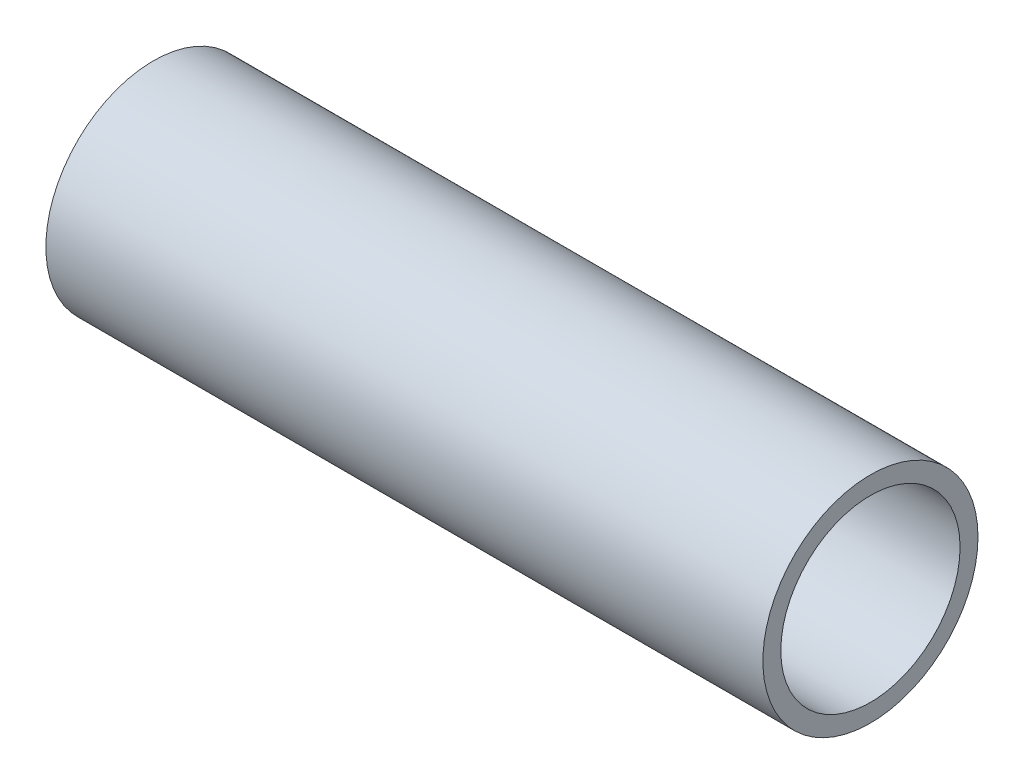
ISO-10303-21;
HEADER;
FILE_DESCRIPTION(('STEP AP214'),'2;1');
FILE_NAME('part.step','',(''),(''),'','','');
FILE_SCHEMA(('AUTOMOTIVE_DESIGN { 1 0 10303 214 1 1 1 1 }'));
ENDSEC;
DATA;
#1=APPLICATION_CONTEXT('core data for automotive mechanical design processes');
#2=APPLICATION_PROTOCOL_DEFINITION('international standard','automotive_design',2000,#1);
#3=PRODUCT_CONTEXT('',#1,'mechanical');
#4=PRODUCT('Part','Part','',(#3));
#5=PRODUCT_RELATED_PRODUCT_CATEGORY('part','',(#4));
#6=PRODUCT_DEFINITION_FORMATION('','',#4);
#7=PRODUCT_DEFINITION_CONTEXT('part definition',#1,'design');
#8=PRODUCT_DEFINITION('design','',#6,#7);
#9=PRODUCT_DEFINITION_SHAPE('','',#8);
#10=(LENGTH_UNIT() NAMED_UNIT(*) SI_UNIT(.MILLI.,.METRE.));
#11=(NAMED_UNIT(*) PLANE_ANGLE_UNIT() SI_UNIT($,.RADIAN.));
#12=(NAMED_UNIT(*) SI_UNIT($,.STERADIAN.) SOLID_ANGLE_UNIT());
#13=UNCERTAINTY_MEASURE_WITH_UNIT(LENGTH_MEASURE(1.E-05),#10,'distance_accuracy_value','');
#14=(GEOMETRIC_REPRESENTATION_CONTEXT(3) GLOBAL_UNCERTAINTY_ASSIGNED_CONTEXT((#13)) GLOBAL_UNIT_ASSIGNED_CONTEXT((#10,
#11,#12)) REPRESENTATION_CONTEXT('',''));
#15=CARTESIAN_POINT('',(0.,0.,0.));
#16=DIRECTION('',(0.,0.,1.));
#17=DIRECTION('',(1.,0.,0.));
#18=AXIS2_PLACEMENT_3D('',#15,#16,#17);
#19=CARTESIAN_POINT('',(400.,0.,0.));
#20=DIRECTION('',(1.,0.,0.));
#21=DIRECTION('',(0.,0.,-1.));
#22=AXIS2_PLACEMENT_3D('',#19,#20,#21);
#23=PLANE('',#22);
#24=CARTESIAN_POINT('',(400.,0.,0.));
#25=DIRECTION('',(1.,0.,0.));
#26=DIRECTION('',(0.,0.,-1.));
#27=AXIS2_PLACEMENT_3D('',#24,#25,#26);
#28=CIRCLE('',#27,60.);
#29=CARTESIAN_POINT('',(400.,0.,-60.));
#30=VERTEX_POINT('',#29);
#31=EDGE_CURVE('E11',#30,#30,#28,.T.);
#32=ORIENTED_EDGE('',*,*,#31,.T.);
#33=EDGE_LOOP('',(#32));
#34=FACE_BOUND('',#33,.T.);
#35=CARTESIAN_POINT('',(400.,0.,0.));
#36=DIRECTION('',(1.,0.,0.));
#37=DIRECTION('',(0.,0.,-1.));
#38=AXIS2_PLACEMENT_3D('',#35,#36,#37);
#39=CIRCLE('',#38,50.);
#40=CARTESIAN_POINT('',(400.,0.,-50.));
#41=VERTEX_POINT('',#40);
#42=EDGE_CURVE('E56',#41,#41,#39,.T.);
#43=ORIENTED_EDGE('',*,*,#42,.F.);
#44=EDGE_LOOP('',(#43));
#45=FACE_BOUND('',#44,.T.);
#46=ADVANCED_FACE('F37',(#34,#45),#23,.T.);
#47=CARTESIAN_POINT('',(0.,0.,0.));
#48=DIRECTION('',(1.,0.,0.));
#49=DIRECTION('',(0.,0.,-1.));
#50=AXIS2_PLACEMENT_3D('',#47,#48,#49);
#51=PLANE('',#50);
#52=CARTESIAN_POINT('',(0.,0.,0.));
#53=DIRECTION('',(1.,0.,0.));
#54=DIRECTION('',(0.,0.,-1.));
#55=AXIS2_PLACEMENT_3D('',#52,#53,#54);
#56=CIRCLE('',#55,60.);
#57=CARTESIAN_POINT('',(0.,0.,-60.));
#58=VERTEX_POINT('',#57);
#59=EDGE_CURVE('E51',#58,#58,#56,.T.);
#60=ORIENTED_EDGE('',*,*,#59,.F.);
#61=EDGE_LOOP('',(#60));
#62=FACE_BOUND('',#61,.T.);
#63=CARTESIAN_POINT('',(0.,0.,0.));
#64=DIRECTION('',(1.,0.,0.));
#65=DIRECTION('',(0.,0.,-1.));
#66=AXIS2_PLACEMENT_3D('',#63,#64,#65);
#67=CIRCLE('',#66,50.);
#68=CARTESIAN_POINT('',(0.,0.,-50.));
#69=VERTEX_POINT('',#68);
#70=EDGE_CURVE('E58',#69,#69,#67,.T.);
#71=ORIENTED_EDGE('',*,*,#70,.T.);
#72=EDGE_LOOP('',(#71));
#73=FACE_BOUND('',#72,.T.);
#74=ADVANCED_FACE('F81',(#62,#73),#51,.F.);
#75=CARTESIAN_POINT('',(400.,0.,0.));
#76=DIRECTION('',(-1.,0.,0.));
#77=DIRECTION('',(0.,0.,1.));
#78=AXIS2_PLACEMENT_3D('',#75,#76,#77);
#79=CYLINDRICAL_SURFACE('',#78,60.);
#80=CARTESIAN_POINT('',(240.,0.,-60.));
#81=CARTESIAN_POINT('',(239.999999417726,1.00486330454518,-59.9999994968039));
#82=CARTESIAN_POINT('',(239.962083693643,2.00973297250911,-59.9747024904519));
#83=CARTESIAN_POINT('',(239.811017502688,4.01125743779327,-59.8741509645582));
#84=CARTESIAN_POINT('',(239.697866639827,5.00791219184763,-59.7988961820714));
#85=CARTESIAN_POINT('',(239.398000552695,6.98557742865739,-59.6002504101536));
#86=CARTESIAN_POINT('',(239.211256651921,7.96658165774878,-59.4768406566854));
#87=CARTESIAN_POINT('',(238.766879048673,9.90547341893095,-59.1848197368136));
#88=CARTESIAN_POINT('',(238.509244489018,10.8633606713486,-59.0162080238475));
#89=CARTESIAN_POINT('',(237.927840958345,12.7453663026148,-58.6384902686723));
#90=CARTESIAN_POINT('',(237.604393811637,13.6696241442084,-58.4295815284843));
#91=CARTESIAN_POINT('',(236.894317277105,15.4841414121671,-57.9751346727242));
#92=CARTESIAN_POINT('',(236.507688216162,16.3744010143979,-57.7295967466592));
#93=CARTESIAN_POINT('',(235.675061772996,18.1169109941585,-57.2066873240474));
#94=CARTESIAN_POINT('',(235.229064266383,18.9691612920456,-56.9293157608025));
#95=CARTESIAN_POINT('',(234.281404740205,20.6325394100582,-56.347801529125));
#96=CARTESIAN_POINT('',(233.779740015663,21.4436652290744,-56.0436575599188));
#97=CARTESIAN_POINT('',(232.679409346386,23.0893332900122,-55.3871156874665));
#98=CARTESIAN_POINT('',(232.076125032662,23.9200269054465,-55.0328130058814));
#99=CARTESIAN_POINT('',(230.81200785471,25.5277510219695,-54.3057312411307));
#100=CARTESIAN_POINT('',(230.15117237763,26.3047790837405,-53.9329513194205));
#101=CARTESIAN_POINT('',(228.774339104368,27.8042229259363,-53.1754792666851));
#102=CARTESIAN_POINT('',(228.058268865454,28.5265644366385,-52.7907719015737));
#103=CARTESIAN_POINT('',(226.574443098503,29.9137194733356,-52.0173061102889));
#104=CARTESIAN_POINT('',(225.806684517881,30.5785295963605,-51.6285474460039));
#105=CARTESIAN_POINT('',(224.09645518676,31.9490834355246,-50.7936732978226));
#106=CARTESIAN_POINT('',(223.145538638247,32.6447172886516,-50.3481930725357));
#107=CARTESIAN_POINT('',(221.179931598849,33.952975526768,-49.4753878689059));
#108=CARTESIAN_POINT('',(220.165226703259,34.5655810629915,-49.0480670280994));
#109=CARTESIAN_POINT('',(218.076384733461,35.7023288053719,-48.2269083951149));
#110=CARTESIAN_POINT('',(217.002330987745,36.2265910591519,-47.8330255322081));
#111=CARTESIAN_POINT('',(214.797419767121,37.181690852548,-47.0944422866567));
#112=CARTESIAN_POINT('',(213.666589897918,37.6125732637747,-46.7497183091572));
#113=CARTESIAN_POINT('',(211.688098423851,38.2640577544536,-46.2167109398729));
#114=CARTESIAN_POINT('',(210.85296034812,38.5094524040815,-46.0119976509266));
#115=CARTESIAN_POINT('',(209.160161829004,38.9468252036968,-45.6423806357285));
#116=CARTESIAN_POINT('',(208.302505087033,39.1388120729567,-45.4774704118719));
#117=CARTESIAN_POINT('',(206.570323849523,39.4665246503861,-45.1933685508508));
#118=CARTESIAN_POINT('',(205.69582628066,39.6023334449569,-45.0741094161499));
#119=CARTESIAN_POINT('',(203.934354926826,39.8159239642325,-44.8855503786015));
#120=CARTESIAN_POINT('',(203.047381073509,39.8937053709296,-44.8162507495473));
#121=CARTESIAN_POINT('',(201.263947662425,39.9900380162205,-44.730315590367));
#122=CARTESIAN_POINT('',(200.367464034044,40.0083426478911,-44.713899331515));
#123=CARTESIAN_POINT('',(198.575938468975,39.9846795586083,-44.7350604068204));
#124=CARTESIAN_POINT('',(197.680896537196,39.9427116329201,-44.7726379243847));
#125=CARTESIAN_POINT('',(195.898750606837,39.799241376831,-44.9002171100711));
#126=CARTESIAN_POINT('',(195.011653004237,39.6976948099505,-44.9902577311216));
#127=CARTESIAN_POINT('',(193.252447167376,39.436802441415,-45.2191173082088));
#128=CARTESIAN_POINT('',(192.380339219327,39.2774555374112,-45.3579371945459));
#129=CARTESIAN_POINT('',(190.694798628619,38.9117417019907,-45.6720005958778));
#130=CARTESIAN_POINT('',(189.880482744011,38.7077853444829,-45.8453462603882));
#131=CARTESIAN_POINT('',(188.273489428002,38.251626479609,-46.2266306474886));
#132=CARTESIAN_POINT('',(187.480820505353,37.999405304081,-46.434582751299));
#133=CARTESIAN_POINT('',(185.919911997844,37.4491133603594,-46.8795160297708));
#134=CARTESIAN_POINT('',(185.151674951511,37.1510378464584,-47.1165002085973));
#135=CARTESIAN_POINT('',(183.641695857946,36.5113426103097,-47.6139262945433));
#136=CARTESIAN_POINT('',(182.899947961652,36.1697325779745,-47.8743629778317));
#137=CARTESIAN_POINT('',(181.295731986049,35.3710116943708,-48.4684121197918));
#138=CARTESIAN_POINT('',(180.439432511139,34.9045455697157,-48.8061273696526));
#139=CARTESIAN_POINT('',(178.768422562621,33.9140631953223,-49.4995138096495));
#140=CARTESIAN_POINT('',(177.95371607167,33.390041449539,-49.8551867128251));
#141=CARTESIAN_POINT('',(176.366512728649,32.2861224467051,-50.5770864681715));
#142=CARTESIAN_POINT('',(175.594063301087,31.7061643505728,-50.9433245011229));
#143=CARTESIAN_POINT('',(174.09391618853,30.4927149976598,-51.6787949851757));
#144=CARTESIAN_POINT('',(173.366221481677,29.8592201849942,-52.0480276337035));
#145=CARTESIAN_POINT('',(171.805395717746,28.3978976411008,-52.8620988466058));
#146=CARTESIAN_POINT('',(170.983393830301,27.5576321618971,-53.3060606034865));
#147=CARTESIAN_POINT('',(169.412496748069,25.802935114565,-54.1771932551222));
#148=CARTESIAN_POINT('',(168.663615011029,24.8884899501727,-54.6043610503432));
#149=CARTESIAN_POINT('',(167.244963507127,22.9893722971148,-55.4306802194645));
#150=CARTESIAN_POINT('',(166.575135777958,22.0047521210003,-55.8298520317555));
#151=CARTESIAN_POINT('',(165.320469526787,19.9689470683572,-56.5899352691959));
#152=CARTESIAN_POINT('',(164.735607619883,18.9177806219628,-56.9508572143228));
#153=CARTESIAN_POINT('',(163.763618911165,16.9666922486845,-57.5583288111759));
#154=CARTESIAN_POINT('',(163.360204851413,16.0775143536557,-57.8134295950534));
#155=CARTESIAN_POINT('',(162.616753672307,14.2637006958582,-58.287434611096));
#156=CARTESIAN_POINT('',(162.27670914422,13.3390690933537,-58.5063430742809));
#157=CARTESIAN_POINT('',(161.664012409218,11.4598454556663,-58.90325550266));
#158=CARTESIAN_POINT('',(161.391314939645,10.5052740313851,-59.0812869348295));
#159=CARTESIAN_POINT('',(160.916495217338,8.57150864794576,-59.3926610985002));
#160=CARTESIAN_POINT('',(160.714374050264,7.59231431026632,-59.5260031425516));
#161=CARTESIAN_POINT('',(160.382853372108,5.61194628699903,-59.7453157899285));
#162=CARTESIAN_POINT('',(160.253775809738,4.61069519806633,-59.8310766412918));
#163=CARTESIAN_POINT('',(160.071690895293,2.59823982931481,-59.9521912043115));
#164=CARTESIAN_POINT('',(160.018683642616,1.58703553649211,-59.9875448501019));
#165=CARTESIAN_POINT('',(159.989583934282,-0.436929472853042,-60.0069435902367));
#166=CARTESIAN_POINT('',(160.013488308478,-1.44969012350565,-59.990990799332));
#167=CARTESIAN_POINT('',(160.137825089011,-3.46836313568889,-59.908186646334));
#168=CARTESIAN_POINT('',(160.238254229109,-4.47427578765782,-59.8413374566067));
#169=CARTESIAN_POINT('',(160.504337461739,-6.40084352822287,-59.6648829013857));
#170=CARTESIAN_POINT('',(160.66490330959,-7.32251623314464,-59.5586180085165));
#171=CARTESIAN_POINT('',(161.0487317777,-9.14700315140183,-59.3058212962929));
#172=CARTESIAN_POINT('',(161.271990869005,-10.0498184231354,-59.1592917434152));
#173=CARTESIAN_POINT('',(161.778604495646,-11.8314321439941,-58.8288893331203));
#174=CARTESIAN_POINT('',(162.061962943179,-12.7102290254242,-58.6450140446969));
#175=CARTESIAN_POINT('',(162.685784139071,-14.4393277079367,-58.243400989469));
#176=CARTESIAN_POINT('',(163.026249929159,-15.2896279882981,-58.0256614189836));
#177=CARTESIAN_POINT('',(163.783369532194,-17.0085335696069,-57.5460976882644));
#178=CARTESIAN_POINT('',(164.20338654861,-17.8751339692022,-57.2824033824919));
#179=CARTESIAN_POINT('',(165.100340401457,-19.5686502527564,-56.7262060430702));
#180=CARTESIAN_POINT('',(165.577278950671,-20.395564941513,-56.4337021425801));
#181=CARTESIAN_POINT('',(166.584765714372,-22.0074044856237,-55.8248751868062));
#182=CARTESIAN_POINT('',(167.115339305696,-22.7923091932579,-55.5085408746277));
#183=CARTESIAN_POINT('',(168.226693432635,-24.3176395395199,-54.8574535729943));
#184=CARTESIAN_POINT('',(168.807476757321,-25.0580627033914,-54.5226995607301));
#185=CARTESIAN_POINT('',(170.112094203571,-26.6062694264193,-53.7861759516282));
#186=CARTESIAN_POINT('',(170.844025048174,-27.406184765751,-53.382181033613));
#187=CARTESIAN_POINT('',(172.367867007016,-28.9419367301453,-52.5653965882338));
#188=CARTESIAN_POINT('',(173.159786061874,-29.6777648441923,-52.1526059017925));
#189=CARTESIAN_POINT('',(174.801195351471,-31.0835760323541,-51.3271479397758));
#190=CARTESIAN_POINT('',(175.65072432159,-31.7535140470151,-50.9144809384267));
#191=CARTESIAN_POINT('',(177.404470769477,-33.0244551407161,-50.0994522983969));
#192=CARTESIAN_POINT('',(178.308682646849,-33.6254652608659,-49.697089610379));
#193=CARTESIAN_POINT('',(180.091034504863,-34.7077254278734,-48.9466046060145));
#194=CARTESIAN_POINT('',(180.964914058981,-35.1948048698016,-48.5967727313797));
#195=CARTESIAN_POINT('',(182.755109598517,-36.1057092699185,-47.9238814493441));
#196=CARTESIAN_POINT('',(183.671426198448,-36.5295333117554,-47.6008224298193));
#197=CARTESIAN_POINT('',(185.542677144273,-37.3096742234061,-46.9918381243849));
#198=CARTESIAN_POINT('',(186.497552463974,-37.6660898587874,-46.7058587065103));
#199=CARTESIAN_POINT('',(188.443450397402,-38.3078968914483,-46.1809182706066));
#200=CARTESIAN_POINT('',(189.434464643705,-38.5933046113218,-45.9419464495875));
#201=CARTESIAN_POINT('',(191.266034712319,-39.0440828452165,-45.5590890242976));
#202=CARTESIAN_POINT('',(192.101599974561,-39.2218098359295,-45.4058321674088));
#203=CARTESIAN_POINT('',(193.789062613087,-39.5241525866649,-45.1429027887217));
#204=CARTESIAN_POINT('',(194.640958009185,-39.6487747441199,-45.0332250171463));
#205=CARTESIAN_POINT('',(196.35501761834,-39.8429074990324,-44.8615604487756));
#206=CARTESIAN_POINT('',(197.217171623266,-39.9124688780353,-44.7995297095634));
#207=CARTESIAN_POINT('',(198.946362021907,-39.9954877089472,-44.7254303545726));
#208=CARTESIAN_POINT('',(199.813398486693,-40.0089443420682,-44.7133624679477));
#209=CARTESIAN_POINT('',(201.546230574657,-39.979501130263,-44.7396899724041));
#210=CARTESIAN_POINT('',(202.412025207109,-39.9365691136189,-44.7781141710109));
#211=CARTESIAN_POINT('',(204.135405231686,-39.7950504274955,-44.90392887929));
#212=CARTESIAN_POINT('',(204.992990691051,-39.696464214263,-44.9913189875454));
#213=CARTESIAN_POINT('',(206.695163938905,-39.4450990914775,-45.2118569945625));
#214=CARTESIAN_POINT('',(207.539735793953,-39.2922585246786,-45.3450569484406));
#215=CARTESIAN_POINT('',(209.210162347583,-38.9345969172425,-45.6525204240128));
#216=CARTESIAN_POINT('',(210.0360146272,-38.7297692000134,-45.8267892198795));
#217=CARTESIAN_POINT('',(211.882463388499,-38.2093696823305,-46.2621637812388));
#218=CARTESIAN_POINT('',(212.896321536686,-37.878832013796,-46.5340350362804));
#219=CARTESIAN_POINT('',(214.882953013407,-37.1432441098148,-47.1232556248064));
#220=CARTESIAN_POINT('',(215.855714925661,-36.7381733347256,-47.4406174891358));
#221=CARTESIAN_POINT('',(217.757719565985,-35.8575360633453,-48.1096989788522));
#222=CARTESIAN_POINT('',(218.686914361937,-35.3818942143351,-48.4614551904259));
#223=CARTESIAN_POINT('',(220.498369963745,-34.364170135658,-49.1883605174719));
#224=CARTESIAN_POINT('',(221.380633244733,-33.8220914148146,-49.5635083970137));
#225=CARTESIAN_POINT('',(223.112090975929,-32.6639811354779,-50.334451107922));
#226=CARTESIAN_POINT('',(223.960393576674,-32.0467850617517,-50.730497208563));
#227=CARTESIAN_POINT('',(225.604581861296,-30.749020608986,-51.5274452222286));
#228=CARTESIAN_POINT('',(226.400467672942,-30.0684523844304,-51.928347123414));
#229=CARTESIAN_POINT('',(227.937705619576,-28.6457956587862,-52.7265002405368));
#230=CARTESIAN_POINT('',(228.679042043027,-27.9036895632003,-53.1237503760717));
#231=CARTESIAN_POINT('',(230.104020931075,-26.3600322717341,-53.9063785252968));
#232=CARTESIAN_POINT('',(230.787658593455,-25.5584761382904,-54.291755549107));
#233=CARTESIAN_POINT('',(232.187538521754,-23.7786056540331,-55.096861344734));
#234=CARTESIAN_POINT('',(232.894329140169,-22.7914495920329,-55.5135592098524));
#235=CARTESIAN_POINT('',(234.221279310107,-20.7458344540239,-56.3099843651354));
#236=CARTESIAN_POINT('',(234.841426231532,-19.68736501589,-56.6897062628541));
#237=CARTESIAN_POINT('',(235.700377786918,-18.0516522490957,-57.2229579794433));
#238=CARTESIAN_POINT('',(235.974714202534,-17.4986612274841,-57.3945873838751));
#239=CARTESIAN_POINT('',(236.498847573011,-16.3773309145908,-57.7245559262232));
#240=CARTESIAN_POINT('',(236.74864795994,-15.8089937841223,-57.8828969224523));
#241=CARTESIAN_POINT('',(237.222673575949,-14.6580964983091,-58.1849987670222));
#242=CARTESIAN_POINT('',(237.446904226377,-14.0755393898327,-58.328762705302));
#243=CARTESIAN_POINT('',(237.868844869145,-12.8973718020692,-58.6005409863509));
#244=CARTESIAN_POINT('',(238.066556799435,-12.3017622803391,-58.7285564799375));
#245=CARTESIAN_POINT('',(238.536734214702,-10.7646074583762,-59.0341625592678));
#246=CARTESIAN_POINT('',(238.789751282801,-9.81460976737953,-59.1998120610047));
#247=CARTESIAN_POINT('',(239.226043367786,-7.89233195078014,-59.486599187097));
#248=CARTESIAN_POINT('',(239.409329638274,-6.92005544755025,-59.6077439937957));
#249=CARTESIAN_POINT('',(239.703582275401,-4.96048196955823,-59.8026945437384));
#250=CARTESIAN_POINT('',(239.814593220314,-3.9731946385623,-59.8765294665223));
#251=CARTESIAN_POINT('',(239.962803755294,-1.99060715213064,-59.9751833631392));
#252=CARTESIAN_POINT('',(240.000000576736,-0.995306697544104,-60.0000004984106));
#253=CARTESIAN_POINT('',(240.,0.,-60.));
#254=B_SPLINE_CURVE_WITH_KNOTS('',3,(#80,#81,#82,#83,#84,#85,#86,#87,#88,#89,#90,#91,#92,#93,
#94,#95,#96,#97,#98,#99,#100,#101,#102,#103,#104,#105,#106,#107,#108,#109,#110,#111,#112,#113,
#114,#115,#116,#117,#118,#119,#120,#121,#122,#123,#124,#125,#126,#127,#128,#129,#130,#131,#132,
#133,#134,#135,#136,#137,#138,#139,#140,#141,#142,#143,#144,#145,#146,#147,#148,#149,#150,#151,
#152,#153,#154,#155,#156,#157,#158,#159,#160,#161,#162,#163,#164,#165,#166,#167,#168,#169,#170,
#171,#172,#173,#174,#175,#176,#177,#178,#179,#180,#181,#182,#183,#184,#185,#186,#187,#188,#189,
#190,#191,#192,#193,#194,#195,#196,#197,#198,#199,#200,#201,#202,#203,#204,#205,#206,#207,#208,
#209,#210,#211,#212,#213,#214,#215,#216,#217,#218,#219,#220,#221,#222,#223,#224,#225,#226,#227,
#228,#229,#230,#231,#232,#233,#234,#235,#236,#237,#238,#239,#240,#241,#242,#243,#244,#245,#246,
#247,#248,#249,#250,#251,#252,#253),.UNSPECIFIED.,.T.,.F.,(4,2,2,2,2,2,2,2,2,2,2,2,2,2,2,2,2,2,
2,2,2,2,2,2,2,2,2,2,2,2,2,2,2,2,2,2,2,2,2,2,2,2,2,2,2,2,2,2,2,2,2,2,2,2,2,2,2,2,2,2,2,2,2,2,2,2,
2,2,2,2,2,2,2,2,2,2,2,2,2,2,2,2,2,2,2,2,4),(0.,3.01357720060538,6.02717026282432,
9.04193877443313,12.0567437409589,15.0571460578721,18.0575328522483,21.0579259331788,
24.0584648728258,27.3134889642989,30.5686609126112,33.828177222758,37.0878862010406,
40.8622638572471,44.6374969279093,48.4075578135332,52.1758030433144,54.85593019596,
57.5356195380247,60.2113313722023,62.8870578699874,65.573864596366,68.2606804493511,
70.9494937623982,73.6383583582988,76.2074526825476,78.777542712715,81.3478989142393,
83.9176840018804,87.0106714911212,90.1039545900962,93.2006408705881,96.2975329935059,
100.062643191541,103.82844505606,107.5914684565,111.353454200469,114.377999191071,
117.402190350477,120.424343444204,123.446543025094,126.48196159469,129.517384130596,
132.55268155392,135.587849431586,138.409392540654,141.230776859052,144.052344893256,
146.874063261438,149.866497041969,152.859020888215,155.852967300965,158.84708012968,
162.314751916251,165.782883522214,169.253370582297,172.723502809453,175.900211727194,
179.076966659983,182.249030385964,185.420364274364,188.021408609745,190.622139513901,
193.220469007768,195.8188364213,198.418686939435,201.018516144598,203.621309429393,
206.224437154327,209.521126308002,212.818725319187,216.119871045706,219.42084249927,
222.781777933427,226.142705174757,229.504596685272,232.866767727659,236.712493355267,
240.558778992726,242.480270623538,244.4014930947,246.322307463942,248.242981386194,
251.230112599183,254.216761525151,257.201566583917,260.18648359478),.UNSPECIFIED.);
#255=CARTESIAN_POINT('',(240.,0.,-60.));
#256=VERTEX_POINT('',#255);
#257=EDGE_CURVE('E61',#256,#256,#254,.T.);
#258=ORIENTED_EDGE('',*,*,#257,.T.);
#259=EDGE_LOOP('',(#258));
#260=FACE_BOUND('',#259,.T.);
#261=ORIENTED_EDGE('',*,*,#31,.F.);
#262=EDGE_LOOP('',(#261));
#263=FACE_BOUND('',#262,.T.);
#264=ORIENTED_EDGE('',*,*,#59,.T.);
#265=EDGE_LOOP('',(#264));
#266=FACE_BOUND('',#265,.T.);
#267=ADVANCED_FACE('F39',(#260,#263,#266),#79,.T.);
#268=CARTESIAN_POINT('',(400.,0.,0.));
#269=DIRECTION('',(-1.,0.,0.));
#270=DIRECTION('',(0.,0.,1.));
#271=AXIS2_PLACEMENT_3D('',#268,#269,#270);
#272=CYLINDRICAL_SURFACE('',#271,50.);
#273=CARTESIAN_POINT('',(240.,0.,-50.));
#274=CARTESIAN_POINT('',(239.999989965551,0.960337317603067,-49.9999902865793));
#275=CARTESIAN_POINT('',(239.965344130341,1.92103825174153,-49.9722619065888));
#276=CARTESIAN_POINT('',(239.827340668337,3.8346071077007,-49.8619634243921));
#277=CARTESIAN_POINT('',(239.723946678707,4.78747061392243,-49.7793642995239));
#278=CARTESIAN_POINT('',(239.450009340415,6.67920680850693,-49.5610369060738));
#279=CARTESIAN_POINT('',(239.27933763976,7.61804917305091,-49.425207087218));
#280=CARTESIAN_POINT('',(238.87373837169,9.47278784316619,-49.103485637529));
#281=CARTESIAN_POINT('',(238.638817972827,10.3886866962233,-48.9175995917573));
#282=CARTESIAN_POINT('',(238.110003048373,12.1860448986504,-48.5009896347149));
#283=CARTESIAN_POINT('',(237.816496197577,13.0676873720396,-48.2705607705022));
#284=CARTESIAN_POINT('',(237.173486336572,14.7981074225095,-47.7684806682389));
#285=CARTESIAN_POINT('',(236.823982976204,15.6468847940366,-47.4968291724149));
#286=CARTESIAN_POINT('',(236.073099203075,17.3078631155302,-46.917071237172));
#287=CARTESIAN_POINT('',(235.67173175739,18.1200731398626,-46.6089739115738));
#288=CARTESIAN_POINT('',(234.820820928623,19.7058441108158,-45.9609995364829));
#289=CARTESIAN_POINT('',(234.371267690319,20.4793971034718,-45.6211159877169));
#290=CARTESIAN_POINT('',(233.581386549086,21.7405090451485,-45.0296027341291));
#291=CARTESIAN_POINT('',(233.253165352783,22.2391661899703,-44.785278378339));
#292=CARTESIAN_POINT('',(232.577557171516,23.2175821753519,-44.2859517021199));
#293=CARTESIAN_POINT('',(232.230174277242,23.6973450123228,-44.0309516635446));
#294=CARTESIAN_POINT('',(231.160274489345,25.1083888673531,-43.2518566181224));
#295=CARTESIAN_POINT('',(230.410118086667,26.0112478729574,-42.7137507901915));
#296=CARTESIAN_POINT('',(228.840444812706,27.7416200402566,-41.6107960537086));
#297=CARTESIAN_POINT('',(228.020749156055,28.5689268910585,-41.0458799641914));
#298=CARTESIAN_POINT('',(226.317857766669,30.1449198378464,-39.9027716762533));
#299=CARTESIAN_POINT('',(225.434669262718,30.8936148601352,-39.3245809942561));
#300=CARTESIAN_POINT('',(223.592558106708,32.322928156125,-38.158764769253));
#301=CARTESIAN_POINT('',(222.632666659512,33.0022979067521,-37.5711331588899));
#302=CARTESIAN_POINT('',(221.145835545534,33.9588113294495,-36.7013004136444));
#303=CARTESIAN_POINT('',(220.64224039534,34.2673057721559,-36.4132103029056));
#304=CARTESIAN_POINT('',(219.619273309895,34.8630820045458,-35.843204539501));
#305=CARTESIAN_POINT('',(219.099902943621,35.1503658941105,-35.5612882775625));
#306=CARTESIAN_POINT('',(218.046651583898,35.7025344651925,-35.0068809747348));
#307=CARTESIAN_POINT('',(217.512813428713,35.9674773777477,-34.7343665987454));
#308=CARTESIAN_POINT('',(216.429076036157,36.4752457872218,-34.20076131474));
#309=CARTESIAN_POINT('',(215.879175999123,36.7180701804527,-33.9396709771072));
#310=CARTESIAN_POINT('',(214.763619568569,37.1806380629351,-33.4322884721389));
#311=CARTESIAN_POINT('',(214.197975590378,37.4003991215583,-33.1859851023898));
#312=CARTESIAN_POINT('',(213.050556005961,37.8160719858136,-32.7115298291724));
#313=CARTESIAN_POINT('',(212.468781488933,38.0119853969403,-32.4833767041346));
#314=CARTESIAN_POINT('',(211.200815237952,38.4063287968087,-32.0165695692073));
#315=CARTESIAN_POINT('',(210.51204347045,38.6007341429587,-31.7814677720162));
#316=CARTESIAN_POINT('',(209.11450642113,38.9543981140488,-31.3469842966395));
#317=CARTESIAN_POINT('',(208.405744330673,39.1136623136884,-31.1475969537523));
#318=CARTESIAN_POINT('',(206.971740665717,39.3945089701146,-30.7916235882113));
#319=CARTESIAN_POINT('',(206.246537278,39.5161707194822,-30.6349475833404));
#320=CARTESIAN_POINT('',(204.781735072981,39.7200407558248,-30.3701570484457));
#321=CARTESIAN_POINT('',(204.042136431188,39.802249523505,-30.2620419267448));
#322=CARTESIAN_POINT('',(202.546896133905,39.9259430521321,-30.09866807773));
#323=CARTESIAN_POINT('',(201.791170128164,39.9670566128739,-30.0438912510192));
#324=CARTESIAN_POINT('',(200.276633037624,40.0062151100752,-29.991729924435));
#325=CARTESIAN_POINT('',(199.517822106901,40.0042621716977,-29.9943425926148));
#326=CARTESIAN_POINT('',(198.003382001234,39.9573259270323,-30.0568391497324));
#327=CARTESIAN_POINT('',(197.247755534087,39.9123114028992,-30.1167645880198));
#328=CARTESIAN_POINT('',(195.746506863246,39.7803459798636,-30.2908537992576));
#329=CARTESIAN_POINT('',(195.000886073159,39.6933892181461,-30.4050251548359));
#330=CARTESIAN_POINT('',(193.409256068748,39.4627146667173,-30.7039918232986));
#331=CARTESIAN_POINT('',(192.565783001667,39.3122468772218,-30.8970395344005));
#332=CARTESIAN_POINT('',(190.904171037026,38.9613603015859,-31.3383396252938));
#333=CARTESIAN_POINT('',(190.086037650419,38.7609307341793,-31.5866039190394));
#334=CARTESIAN_POINT('',(188.475893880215,38.3131195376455,-32.1283140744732));
#335=CARTESIAN_POINT('',(187.683953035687,38.0656231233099,-32.4218700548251));
#336=CARTESIAN_POINT('',(186.129176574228,37.5270208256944,-33.0437864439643));
#337=CARTESIAN_POINT('',(185.366343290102,37.2359114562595,-33.3721496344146));
#338=CARTESIAN_POINT('',(184.060276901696,36.6918302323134,-33.9680518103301));
#339=CARTESIAN_POINT('',(183.510543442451,36.4479938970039,-34.2298156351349));
#340=CARTESIAN_POINT('',(182.427058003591,35.9381443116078,-34.7647275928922));
#341=CARTESIAN_POINT('',(181.893307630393,35.6721288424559,-35.0378768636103));
#342=CARTESIAN_POINT('',(180.841478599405,35.1184343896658,-35.592825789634));
#343=CARTESIAN_POINT('',(180.323406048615,34.8307471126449,-35.8746287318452));
#344=CARTESIAN_POINT('',(179.30305084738,34.2342731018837,-36.4442690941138));
#345=CARTESIAN_POINT('',(178.800767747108,33.9254869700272,-36.7321063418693));
#346=CARTESIAN_POINT('',(177.316270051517,32.9672187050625,-37.601947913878));
#347=CARTESIAN_POINT('',(176.357426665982,32.2863649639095,-38.1897349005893));
#348=CARTESIAN_POINT('',(174.503285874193,30.8431085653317,-39.3645658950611));
#349=CARTESIAN_POINT('',(173.607978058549,30.080719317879,-39.9516100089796));
#350=CARTESIAN_POINT('',(171.859919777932,28.453465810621,-41.1270547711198));
#351=CARTESIAN_POINT('',(171.008951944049,27.5864034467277,-41.7150704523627));
#352=CARTESIAN_POINT('',(169.380826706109,25.7673359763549,-42.8625772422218));
#353=CARTESIAN_POINT('',(168.603680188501,24.8153183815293,-43.4220641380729));
#354=CARTESIAN_POINT('',(167.49981524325,23.3263522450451,-44.2289438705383));
#355=CARTESIAN_POINT('',(167.142493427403,22.8204057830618,-44.492266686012));
#356=CARTESIAN_POINT('',(166.449102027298,21.7881562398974,-45.0067623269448));
#357=CARTESIAN_POINT('',(166.113031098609,21.2618544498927,-45.2579359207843));
#358=CARTESIAN_POINT('',(165.463467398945,20.1896164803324,-45.7463252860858));
#359=CARTESIAN_POINT('',(165.149963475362,19.6436902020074,-45.9835479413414));
#360=CARTESIAN_POINT('',(164.546539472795,18.5324581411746,-46.4425398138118));
#361=CARTESIAN_POINT('',(164.256625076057,17.9671477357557,-46.6643053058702));
#362=CARTESIAN_POINT('',(163.58402038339,16.5741428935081,-47.1811352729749));
#363=CARTESIAN_POINT('',(163.214162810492,15.736897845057,-47.4673728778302));
#364=CARTESIAN_POINT('',(162.52923808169,14.0281401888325,-48.0001216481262));
#365=CARTESIAN_POINT('',(162.214157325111,13.1566361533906,-48.2466426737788));
#366=CARTESIAN_POINT('',(161.785660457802,11.8271364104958,-48.5832068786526));
#367=CARTESIAN_POINT('',(161.650193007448,11.3803061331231,-48.6898501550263));
#368=CARTESIAN_POINT('',(161.394404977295,10.4798425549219,-48.8915717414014));
#369=CARTESIAN_POINT('',(161.274081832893,10.0262104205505,-48.9866520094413));
#370=CARTESIAN_POINT('',(160.936470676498,8.65593274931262,-49.2538349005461));
#371=CARTESIAN_POINT('',(160.742508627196,7.72980603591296,-49.4079050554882));
#372=CARTESIAN_POINT('',(160.419226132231,5.85430089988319,-49.66515922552));
#373=CARTESIAN_POINT('',(160.290252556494,4.9048254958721,-49.7680701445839));
#374=CARTESIAN_POINT('',(160.100717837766,2.99469380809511,-49.9194295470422));
#375=CARTESIAN_POINT('',(160.040156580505,2.03403754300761,-49.9678781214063));
#376=CARTESIAN_POINT('',(159.98857399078,0.109806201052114,-50.0091389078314));
#377=CARTESIAN_POINT('',(159.997542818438,-0.853768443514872,-50.0019589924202));
#378=CARTESIAN_POINT('',(160.084831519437,-2.77570927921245,-49.9321537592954));
#379=CARTESIAN_POINT('',(160.163147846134,-3.7340757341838,-49.8695312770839));
#380=CARTESIAN_POINT('',(160.378559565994,-5.56031714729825,-49.6976330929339));
#381=CARTESIAN_POINT('',(160.510367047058,-6.42922228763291,-49.5925574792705));
#382=CARTESIAN_POINT('',(160.829360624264,-8.15026869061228,-49.3389260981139));
#383=CARTESIAN_POINT('',(161.016543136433,-9.00241103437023,-49.1903731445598));
#384=CARTESIAN_POINT('',(161.44379900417,-10.685185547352,-48.8524671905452));
#385=CARTESIAN_POINT('',(161.683882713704,-11.515813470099,-48.6631062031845));
#386=CARTESIAN_POINT('',(162.213988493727,-13.1512899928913,-48.246821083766));
#387=CARTESIAN_POINT('',(162.504013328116,-13.9561371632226,-48.0198948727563));
#388=CARTESIAN_POINT('',(163.15022399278,-15.58553393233,-47.5169685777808));
#389=CARTESIAN_POINT('',(163.509389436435,-16.4082310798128,-47.238803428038));
#390=CARTESIAN_POINT('',(164.27669658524,-18.0177856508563,-46.6486258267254));
#391=CARTESIAN_POINT('',(164.684839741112,-18.8046420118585,-46.3366123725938));
#392=CARTESIAN_POINT('',(165.546404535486,-20.3402264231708,-45.6833815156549));
#393=CARTESIAN_POINT('',(165.999818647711,-21.0889607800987,-45.3421689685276));
#394=CARTESIAN_POINT('',(166.948788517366,-22.547156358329,-44.6349908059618));
#395=CARTESIAN_POINT('',(167.444350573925,-23.2566116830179,-44.2690214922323));
#396=CARTESIAN_POINT('',(168.265780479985,-24.3557219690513,-43.6694047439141));
#397=CARTESIAN_POINT('',(168.579026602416,-24.7584580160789,-43.442239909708));
#398=CARTESIAN_POINT('',(169.21877251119,-25.5494559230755,-42.9817949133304));
#399=CARTESIAN_POINT('',(169.545269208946,-25.9377211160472,-42.7485161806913));
#400=CARTESIAN_POINT('',(170.544157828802,-27.0809500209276,-42.0407585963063));
#401=CARTESIAN_POINT('',(171.235910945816,-27.8142972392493,-41.5583857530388));
#402=CARTESIAN_POINT('',(172.669664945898,-29.2244228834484,-40.5792086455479));
#403=CARTESIAN_POINT('',(173.411798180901,-29.9010409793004,-40.0823684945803));
#404=CARTESIAN_POINT('',(174.94284303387,-31.1952511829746,-39.0835527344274));
#405=CARTESIAN_POINT('',(175.731757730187,-31.812839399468,-38.5815767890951));
#406=CARTESIAN_POINT('',(177.036020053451,-32.7570649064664,-37.7782236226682));
#407=CARTESIAN_POINT('',(177.536993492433,-33.1026381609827,-37.4755625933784));
#408=CARTESIAN_POINT('',(178.555685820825,-33.7714763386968,-36.8739687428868));
#409=CARTESIAN_POINT('',(179.073401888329,-34.0947449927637,-36.5750353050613));
#410=CARTESIAN_POINT('',(180.126028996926,-34.7188696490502,-35.9831237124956));
#411=CARTESIAN_POINT('',(180.660950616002,-35.0197114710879,-35.690149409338));
#412=CARTESIAN_POINT('',(181.747861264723,-35.5982931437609,-35.1130809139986));
#413=CARTESIAN_POINT('',(182.299850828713,-35.876032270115,-34.8289870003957));
#414=CARTESIAN_POINT('',(183.419113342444,-36.4068189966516,-34.2737583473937));
#415=CARTESIAN_POINT('',(183.986325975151,-36.659949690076,-34.0025816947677));
#416=CARTESIAN_POINT('',(185.138080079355,-37.1417962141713,-33.4755799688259));
#417=CARTESIAN_POINT('',(185.722622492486,-37.37051071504,-33.2197557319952));
#418=CARTESIAN_POINT('',(186.908399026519,-37.8022171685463,-32.7276550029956));
#419=CARTESIAN_POINT('',(187.509614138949,-38.0052370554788,-32.4913573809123));
#420=CARTESIAN_POINT('',(188.729035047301,-38.3845411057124,-32.0423686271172));
#421=CARTESIAN_POINT('',(189.347238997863,-38.5608281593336,-31.829674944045));
#422=CARTESIAN_POINT('',(190.647810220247,-38.897575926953,-31.4174279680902));
#423=CARTESIAN_POINT('',(191.331475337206,-39.0558044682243,-31.2201137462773));
#424=CARTESIAN_POINT('',(192.715864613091,-39.3375156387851,-30.8644041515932));
#425=CARTESIAN_POINT('',(193.416585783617,-39.4610043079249,-30.7060020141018));
#426=CARTESIAN_POINT('',(194.830641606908,-39.6709888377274,-30.4342274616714));
#427=CARTESIAN_POINT('',(195.543944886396,-39.757566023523,-30.3207560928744));
#428=CARTESIAN_POINT('',(196.980342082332,-39.8923788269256,-30.1431693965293));
#429=CARTESIAN_POINT('',(197.703435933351,-39.9406147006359,-30.0790537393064));
#430=CARTESIAN_POINT('',(199.157922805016,-39.9977924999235,-30.0029823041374));
#431=CARTESIAN_POINT('',(199.889339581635,-40.0065185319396,-29.9913131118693));
#432=CARTESIAN_POINT('',(201.350410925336,-39.9838747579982,-30.0214936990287));
#433=CARTESIAN_POINT('',(202.080065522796,-39.9525056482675,-30.0633425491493));
#434=CARTESIAN_POINT('',(203.532741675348,-39.850353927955,-30.1986156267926));
#435=CARTESIAN_POINT('',(204.255752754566,-39.7795172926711,-30.2921105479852));
#436=CARTESIAN_POINT('',(205.689236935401,-39.5999333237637,-30.5264953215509));
#437=CARTESIAN_POINT('',(206.399708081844,-39.4911801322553,-30.6673924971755));
#438=CARTESIAN_POINT('',(207.99708822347,-39.2029776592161,-31.0353845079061));
#439=CARTESIAN_POINT('',(208.878972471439,-39.0123208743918,-31.2755207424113));
#440=CARTESIAN_POINT('',(210.612048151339,-38.5769832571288,-31.8109269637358));
#441=CARTESIAN_POINT('',(211.463229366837,-38.3322846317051,-32.1062151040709));
#442=CARTESIAN_POINT('',(213.134965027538,-37.7921453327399,-32.7403049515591));
#443=CARTESIAN_POINT('',(213.95544063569,-37.4965836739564,-33.0792099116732));
#444=CARTESIAN_POINT('',(215.563396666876,-36.858229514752,-33.7890318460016));
#445=CARTESIAN_POINT('',(216.350875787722,-36.5154351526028,-34.1599500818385));
#446=CARTESIAN_POINT('',(217.682646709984,-35.8846591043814,-34.8200978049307));
#447=CARTESIAN_POINT('',(218.234656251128,-35.6072491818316,-35.1039955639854));
#448=CARTESIAN_POINT('',(219.32169685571,-35.0292876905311,-35.6807461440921));
#449=CARTESIAN_POINT('',(219.856726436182,-34.7287341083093,-35.9735997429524));
#450=CARTESIAN_POINT('',(220.910083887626,-34.1048854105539,-36.565581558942));
#451=CARTESIAN_POINT('',(221.428405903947,-33.7815824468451,-36.8647119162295));
#452=CARTESIAN_POINT('',(222.44817247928,-33.1127063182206,-37.4666686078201));
#453=CARTESIAN_POINT('',(222.949617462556,-32.7671337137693,-37.7694948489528));
#454=CARTESIAN_POINT('',(224.429588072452,-31.6966775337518,-38.6807255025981));
#455=CARTESIAN_POINT('',(225.382960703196,-30.9385234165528,-39.2914317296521));
#456=CARTESIAN_POINT('',(227.220077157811,-29.3351889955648,-40.5025504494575));
#457=CARTESIAN_POINT('',(228.103831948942,-28.4900224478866,-41.102964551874));
#458=CARTESIAN_POINT('',(229.809061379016,-26.7014356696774,-42.2871017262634));
#459=CARTESIAN_POINT('',(230.629557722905,-25.7568637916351,-42.8704990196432));
#460=CARTESIAN_POINT('',(232.188673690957,-23.7796863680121,-43.9979659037));
#461=CARTESIAN_POINT('',(232.927279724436,-22.7470662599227,-44.5420289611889));
#462=CARTESIAN_POINT('',(233.965787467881,-21.1360479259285,-45.3169070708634));
#463=CARTESIAN_POINT('',(234.300086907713,-20.5892776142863,-45.568097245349));
#464=CARTESIAN_POINT('',(234.944667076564,-19.4752209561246,-46.0552401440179));
#465=CARTESIAN_POINT('',(235.254951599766,-18.9079378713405,-46.2911952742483));
#466=CARTESIAN_POINT('',(235.85001965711,-17.7538005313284,-46.7459851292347));
#467=CARTESIAN_POINT('',(236.134813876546,-17.1669546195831,-46.9648270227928));
#468=CARTESIAN_POINT('',(236.677559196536,-15.9745348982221,-47.383684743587));
#469=CARTESIAN_POINT('',(236.935513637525,-15.3689634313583,-47.5837029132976));
#470=CARTESIAN_POINT('',(237.507578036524,-13.9274237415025,-48.0289063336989));
#471=CARTESIAN_POINT('',(237.810218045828,-13.0842633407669,-48.2657599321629));
#472=CARTESIAN_POINT('',(238.360595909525,-11.3699203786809,-48.6981142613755));
#473=CARTESIAN_POINT('',(238.608337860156,-10.4987399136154,-48.8936180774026));
#474=CARTESIAN_POINT('',(239.045127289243,-8.73506769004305,-49.2392543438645));
#475=CARTESIAN_POINT('',(239.234306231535,-7.84262857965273,-49.3894883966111));
#476=CARTESIAN_POINT('',(239.551827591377,-6.04063896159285,-49.6420968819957));
#477=CARTESIAN_POINT('',(239.680197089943,-5.13109625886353,-49.7444926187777));
#478=CARTESIAN_POINT('',(239.851208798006,-3.51776144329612,-49.8810276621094));
#479=CARTESIAN_POINT('',(239.906948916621,-2.81621264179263,-49.9255850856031));
#480=CARTESIAN_POINT('',(239.962746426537,-1.76151114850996,-49.9702010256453));
#481=CARTESIAN_POINT('',(239.976710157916,-1.40950530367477,-49.9813696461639));
#482=CARTESIAN_POINT('',(239.995339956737,-0.705016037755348,-49.9962718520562));
#483=CARTESIAN_POINT('',(240.00000368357,-0.352532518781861,-50.0000035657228));
#484=CARTESIAN_POINT('',(240.,0.,-50.));
#485=B_SPLINE_CURVE_WITH_KNOTS('',3,(#273,#274,#275,#276,#277,#278,#279,#280,#281,#282,#283,
#284,#285,#286,#287,#288,#289,#290,#291,#292,#293,#294,#295,#296,#297,#298,#299,#300,#301,#302,
#303,#304,#305,#306,#307,#308,#309,#310,#311,#312,#313,#314,#315,#316,#317,#318,#319,#320,#321,
#322,#323,#324,#325,#326,#327,#328,#329,#330,#331,#332,#333,#334,#335,#336,#337,#338,#339,#340,
#341,#342,#343,#344,#345,#346,#347,#348,#349,#350,#351,#352,#353,#354,#355,#356,#357,#358,#359,
#360,#361,#362,#363,#364,#365,#366,#367,#368,#369,#370,#371,#372,#373,#374,#375,#376,#377,#378,
#379,#380,#381,#382,#383,#384,#385,#386,#387,#388,#389,#390,#391,#392,#393,#394,#395,#396,#397,
#398,#399,#400,#401,#402,#403,#404,#405,#406,#407,#408,#409,#410,#411,#412,#413,#414,#415,#416,
#417,#418,#419,#420,#421,#422,#423,#424,#425,#426,#427,#428,#429,#430,#431,#432,#433,#434,#435,
#436,#437,#438,#439,#440,#441,#442,#443,#444,#445,#446,#447,#448,#449,#450,#451,#452,#453,#454,
#455,#456,#457,#458,#459,#460,#461,#462,#463,#464,#465,#466,#467,#468,#469,#470,#471,#472,#473,
#474,#475,#476,#477,#478,#479,#480,#481,#482,#483,#484),.UNSPECIFIED.,.T.,.F.,(4,2,2,2,2,2,2,2,
2,2,2,2,2,2,2,2,2,2,2,2,2,2,2,2,2,2,2,2,2,2,2,2,2,2,2,2,2,2,2,2,2,2,2,2,2,2,2,2,2,2,2,2,2,2,2,2,
2,2,2,2,2,2,2,2,2,2,2,2,2,2,2,2,2,2,2,2,2,2,2,2,2,2,2,2,2,2,2,2,2,2,2,2,2,2,2,2,2,2,2,2,2,2,2,2,
2,4),(0.,2.88062758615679,5.76278003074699,8.65045784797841,11.5378136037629,14.4066614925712,
17.2755273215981,20.1436772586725,23.0124149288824,24.9469208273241,26.8810153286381,
30.7498793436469,34.6290105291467,38.507700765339,42.4470818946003,44.4179128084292,
46.3885483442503,48.3538775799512,50.3193048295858,52.2832238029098,54.2470104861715,
56.5051583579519,58.7629477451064,61.0159431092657,63.268911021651,65.5420502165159,
67.8150772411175,70.0897533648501,72.3647475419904,74.9955216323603,77.6268639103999,
80.2647076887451,82.9027624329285,84.8697610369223,86.8369566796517,88.8049089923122,
90.7728051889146,94.7124150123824,98.6513778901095,102.695863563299,106.740944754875,
108.759483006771,110.777893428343,112.795299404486,114.813189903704,117.687325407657,
120.560746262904,121.997183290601,123.433376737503,126.305440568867,129.19267556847,
132.079905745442,134.9667273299,137.853401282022,140.505730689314,143.157888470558,
145.810565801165,148.463389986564,151.280030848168,154.096755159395,156.913011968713,
159.729690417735,161.404844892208,163.079611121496,166.429347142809,169.788251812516,
173.147377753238,175.18598961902,177.224259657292,179.263807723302,181.303419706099,
183.335886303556,185.368463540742,187.398811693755,189.428940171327,191.613888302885,
193.798456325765,195.978186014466,198.157901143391,200.349512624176,202.541086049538,
204.735666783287,206.930586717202,209.727217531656,212.524770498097,215.329072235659,
218.133484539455,220.172557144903,222.211807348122,224.251764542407,226.291670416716,
230.374537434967,234.456759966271,238.592973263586,242.72987199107,244.794153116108,
246.85810743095,248.921192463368,250.98402041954,253.760898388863,256.537569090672,
259.307960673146,262.07711732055,264.190991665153,265.248182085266,266.305638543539),.UNSPECIFIED.);
#486=CARTESIAN_POINT('',(240.,0.,-50.));
#487=VERTEX_POINT('',#486);
#488=EDGE_CURVE('E42',#487,#487,#485,.T.);
#489=ORIENTED_EDGE('',*,*,#488,.F.);
#490=EDGE_LOOP('',(#489));
#491=FACE_BOUND('',#490,.T.);
#492=ORIENTED_EDGE('',*,*,#42,.T.);
#493=EDGE_LOOP('',(#492));
#494=FACE_BOUND('',#493,.T.);
#495=ORIENTED_EDGE('',*,*,#70,.F.);
#496=EDGE_LOOP('',(#495));
#497=FACE_BOUND('',#496,.T.);
#498=ADVANCED_FACE('F73',(#491,#494,#497),#272,.F.);
#499=CARTESIAN_POINT('',(200.,0.,-400.));
#500=DIRECTION('',(0.,0.,1.));
#501=DIRECTION('',(1.,0.,0.));
#502=AXIS2_PLACEMENT_3D('',#499,#500,#501);
#503=CYLINDRICAL_SURFACE('',#502,40.);
#504=ORIENTED_EDGE('',*,*,#488,.T.);
#505=EDGE_LOOP('',(#504));
#506=FACE_BOUND('',#505,.T.);
#507=ORIENTED_EDGE('',*,*,#257,.F.);
#508=EDGE_LOOP('',(#507));
#509=FACE_BOUND('',#508,.T.);
#510=ADVANCED_FACE('F70',(#506,#509),#503,.F.);
#511=CLOSED_SHELL('',(#46,#74,#267,#498,#510));
#512=MANIFOLD_SOLID_BREP('B2',#511);
#513=ADVANCED_BREP_SHAPE_REPRESENTATION('',(#18,#512),#14);
#514=SHAPE_DEFINITION_REPRESENTATION(#9,#513);
ENDSEC;
END-ISO-10303-21;
